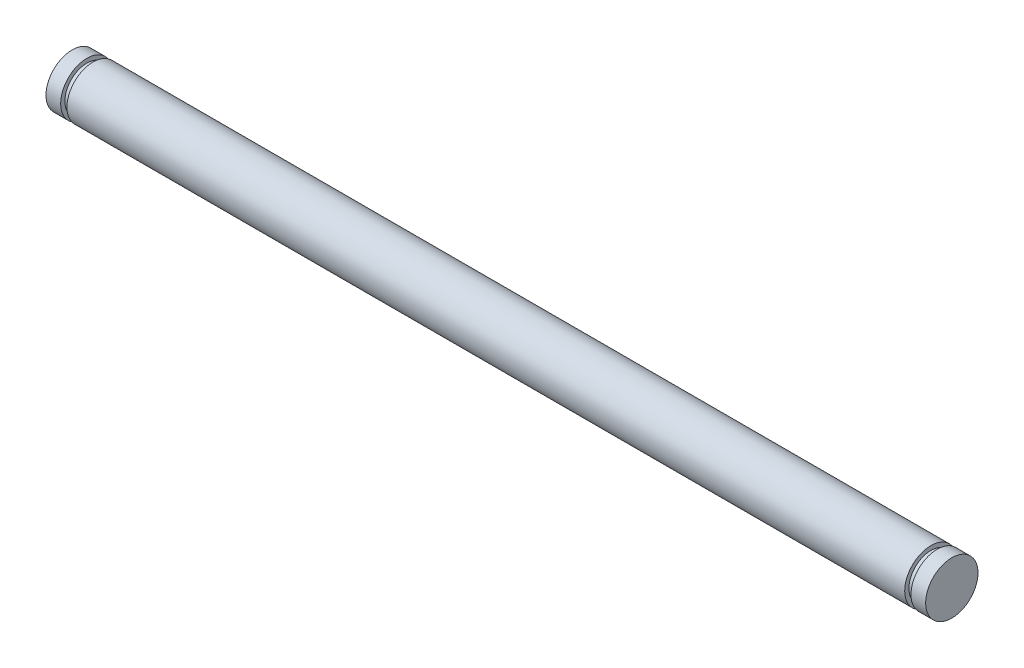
from build123d import *

# Parameters (mm, degrees)
SKETCH1_R           = 3.175
BOSS_EXTRUDE1_DEPTH = 53.34
SKETCH2_W           = 0.762
SKETCH2_H           = 0.508


with BuildPart() as part:
    # Sketch1 → Boss-Extrude1 (new, symmetric)
    with BuildSketch(Plane(origin=(0, 0, 0), x_dir=(0, 0, -1), z_dir=(1, 0, 0))):
        Circle(SKETCH1_R)
    extrude(amount=BOSS_EXTRUDE1_DEPTH, both=True)

    # Sketch2 → Cut-Revolve1 (revolve, cut)
    with BuildSketch(Plane(origin=(0, 0, 0), x_dir=(1, 0, 0), z_dir=(0, 1, 0)), mode=Mode.PRIVATE) as cut_revolve1_sk:
        with Locations((-51.181, 2.921)):
            Rectangle(SKETCH2_W, SKETCH2_H)
        with Locations((51.181, 2.921)):
            Rectangle(SKETCH2_W, SKETCH2_H)
    revolve(cut_revolve1_sk.sketch.rotate(Axis((-53.34, 0, 0), (1, 0, 0)), 180), axis=Axis((-53.34, 0, 0), (1, 0, 0)), mode=Mode.SUBTRACT)


solid = part.part
